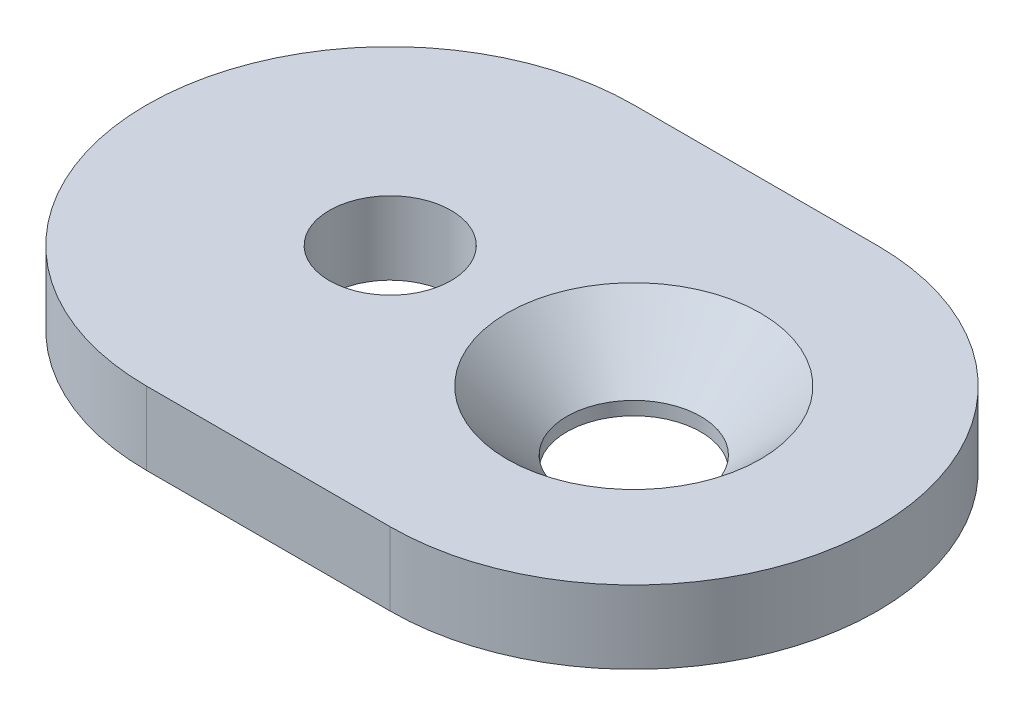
from build123d import *

# Parameters (mm, degrees)
SKETCH1_R      = 2.5
EXTRUDE1_DEPTH = 3


with BuildPart() as part:
    # Sketch1 → Extrude1 (new body)
    with BuildSketch(Plane(origin=(0, 0, 0), x_dir=(1, 0, 0), z_dir=(0, 1, 0))):
        with BuildLine():
            Line((10, 10), (0, 10))
            ThreePointArc((0, 10), (-10, 0), (0, -10))
            Line((0, -10), (10, -10))
            ThreePointArc((10, -10), (20, 0), (10, 10))
        make_face()
        with Locations(Location((0, 0, 0), (0, 0, 270))):
            Circle(SKETCH1_R, mode=Mode.SUBTRACT)
        with Locations(Location((10, 0, 0), (0, 0, 270))):
            Circle(SKETCH1_R, mode=Mode.SUBTRACT)
    extrude(amount=EXTRUDE1_DEPTH)

    # Sketch2 → CSK for M5 Countersunk Flat Head Screw1 (revolve, cut)
    with BuildSketch(Plane(origin=(10, 3, 0), x_dir=(0, 0, 1), z_dir=(1, 0, 0))):
        Polygon((0, 0), (0, 3), (2.75, 3), (2.75, 2.45), (5.2, 0), align=None)
    revolve(axis=Axis((10, 9.35, 0), (0, -1, 0)), mode=Mode.SUBTRACT)


solid = part.part
